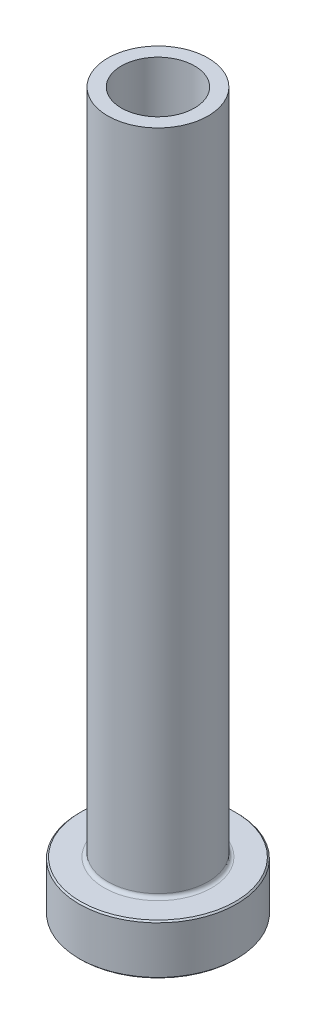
from build123d import *

# Parameters (mm, degrees)
FILLET1_R     = 0.5
CHAMFER1_SIZE = 0.2
CHAMFER3_SIZE = 0.5


with BuildPart() as part:
    # Sketch1 → Revolve1 (revolve)
    with BuildSketch(Plane.XY, mode=Mode.PRIVATE) as revolve1_sk:
        Polygon((-5.1, 100), (-7, 100), (-7, 7), (-11, 7), (-11, 0), (-5.35, 0), (-5.35, 33), (-5.1, 45), align=None)
    revolve(revolve1_sk.sketch.rotate(Axis((0, 92.187680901, 0), (0, -1, 0)), 270), axis=Axis((0, 92.187680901, 0), (0, -1, 0)))

    # Fillet1
    fillet1_edges = [part.edges().sort_by_distance(p)[0] for p in [
        (0, 7, -7),
    ]]
    fillet(fillet1_edges, radius=FILLET1_R)

    # Chamfer1
    chamfer1_edges = [part.edges().sort_by_distance(p)[0] for p in [
        (0, 0, -11),
        (0, 7, -11),
    ]]
    chamfer(chamfer1_edges, length=CHAMFER1_SIZE)

    # Chamfer3
    chamfer3_edges = [part.edges().sort_by_distance(p)[0] for p in [
        (0, 0, -5.35),
    ]]
    chamfer(chamfer3_edges, length=CHAMFER3_SIZE)


solid = part.part
